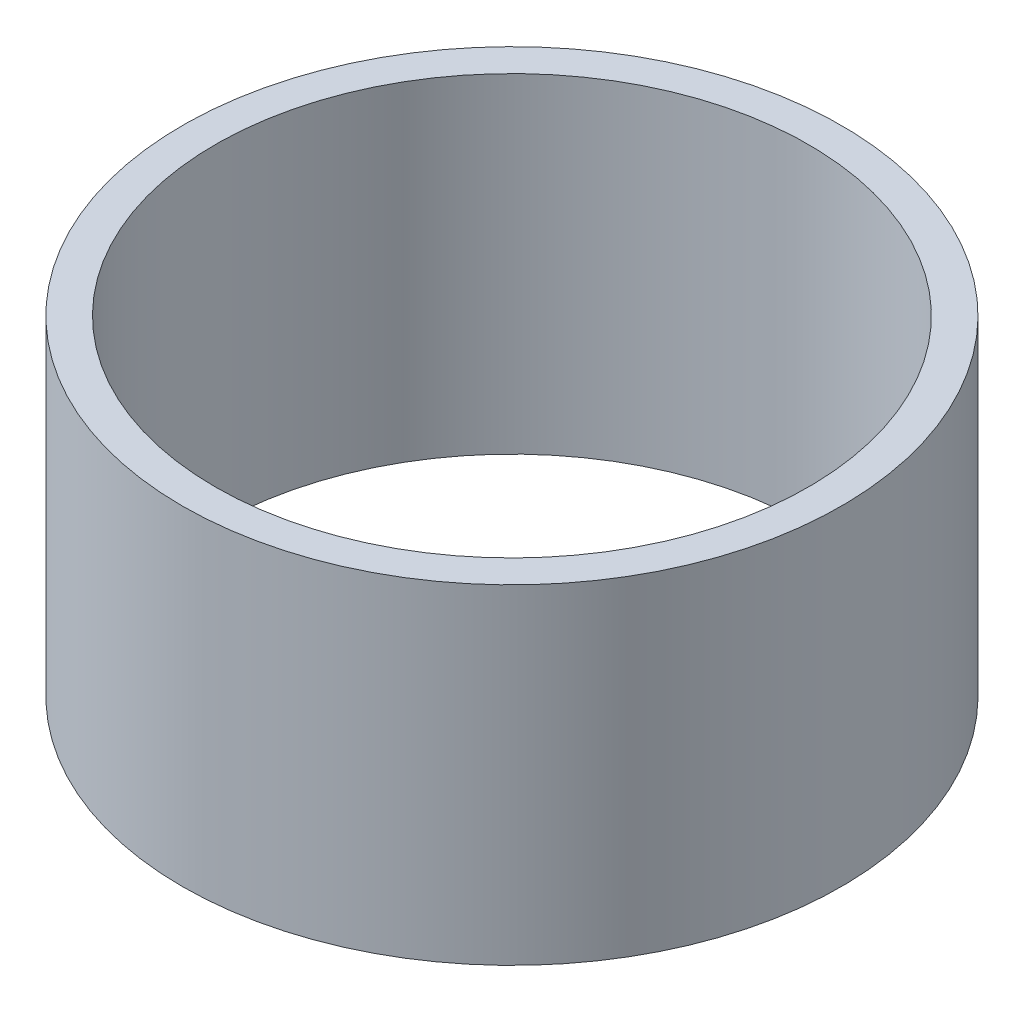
from build123d import *

# Parameters (mm, degrees)
SKIZZE1_R               = 100
SKIZZE1_R_2             = 90
LINEAR_AUSTRAGEN1_DEPTH = 50


with BuildPart() as part:
    # Skizze1 → Linear austragen1 (new, symmetric)
    with BuildSketch(Plane(origin=(0, 0, 0), x_dir=(1, 0, 0), z_dir=(0, 1, 0))):
        with Locations(Location((0, 0, 0), (0, 0, 270))):
            Circle(SKIZZE1_R)
        with Locations(Location((0, 0, 0), (0, 0, 270))):
            Circle(SKIZZE1_R_2, mode=Mode.SUBTRACT)
    extrude(amount=LINEAR_AUSTRAGEN1_DEPTH, both=True)


solid = part.part
